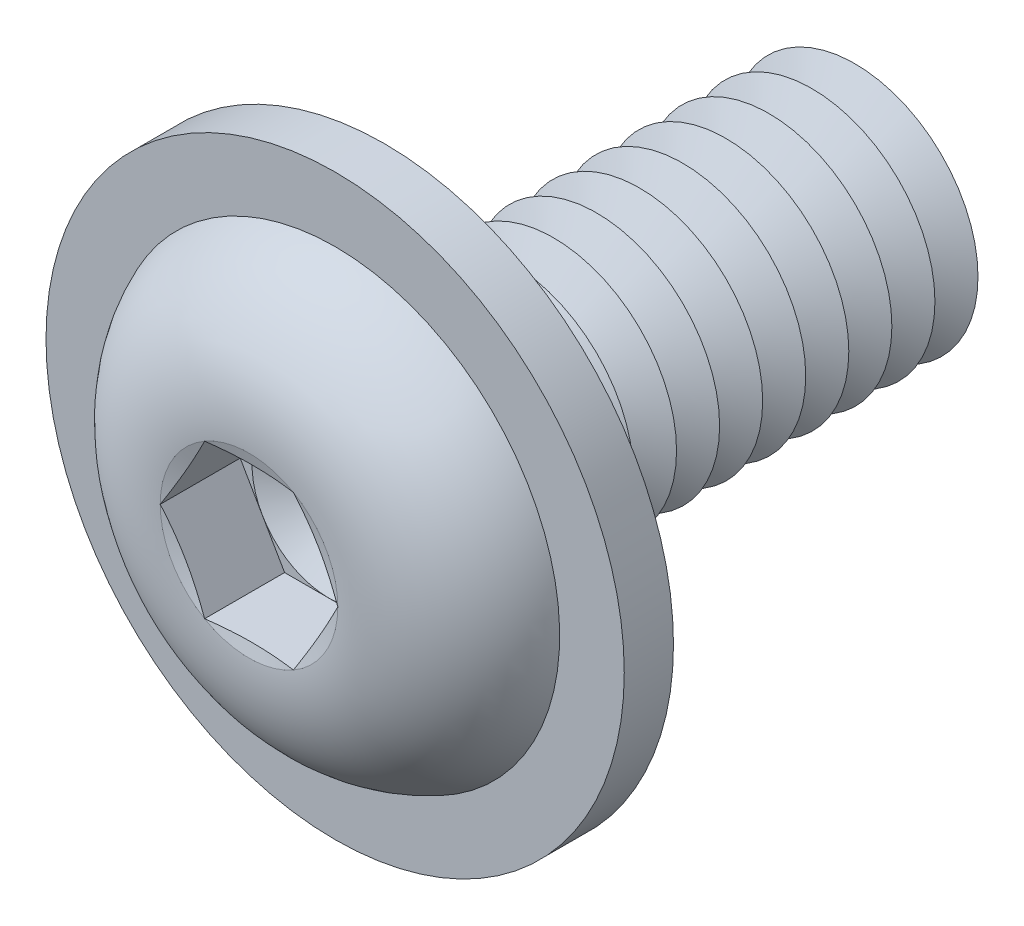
ISO-10303-21;
HEADER;
FILE_DESCRIPTION(('STEP AP214'),'2;1');
FILE_NAME('part.step','',(''),(''),'','','');
FILE_SCHEMA(('AUTOMOTIVE_DESIGN { 1 0 10303 214 1 1 1 1 }'));
ENDSEC;
DATA;
#1=APPLICATION_CONTEXT('core data for automotive mechanical design processes');
#2=APPLICATION_PROTOCOL_DEFINITION('international standard','automotive_design',2000,#1);
#3=PRODUCT_CONTEXT('',#1,'mechanical');
#4=PRODUCT('Part','Part','',(#3));
#5=PRODUCT_RELATED_PRODUCT_CATEGORY('part','',(#4));
#6=PRODUCT_DEFINITION_FORMATION('','',#4);
#7=PRODUCT_DEFINITION_CONTEXT('part definition',#1,'design');
#8=PRODUCT_DEFINITION('design','',#6,#7);
#9=PRODUCT_DEFINITION_SHAPE('','',#8);
#10=(LENGTH_UNIT() NAMED_UNIT(*) SI_UNIT(.MILLI.,.METRE.));
#11=(NAMED_UNIT(*) PLANE_ANGLE_UNIT() SI_UNIT($,.RADIAN.));
#12=(NAMED_UNIT(*) SI_UNIT($,.STERADIAN.) SOLID_ANGLE_UNIT());
#13=UNCERTAINTY_MEASURE_WITH_UNIT(LENGTH_MEASURE(1.E-05),#10,'distance_accuracy_value','');
#14=(GEOMETRIC_REPRESENTATION_CONTEXT(3) GLOBAL_UNCERTAINTY_ASSIGNED_CONTEXT((#13)) GLOBAL_UNIT_ASSIGNED_CONTEXT((#10,
#11,#12)) REPRESENTATION_CONTEXT('',''));
#15=CARTESIAN_POINT('',(0.,0.,0.));
#16=DIRECTION('',(0.,0.,1.));
#17=DIRECTION('',(1.,0.,0.));
#18=AXIS2_PLACEMENT_3D('',#15,#16,#17);
#19=CARTESIAN_POINT('',(0.,0.,-5.55));
#20=DIRECTION('',(0.,0.,1.));
#21=DIRECTION('',(1.,0.,0.));
#22=AXIS2_PLACEMENT_3D('',#19,#20,#21);
#23=CONICAL_SURFACE('',#22,2.,1.0471975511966);
#24=CARTESIAN_POINT('',(0.,0.,-5.9));
#25=DIRECTION('',(0.,0.,1.));
#26=DIRECTION('',(1.,0.,0.));
#27=AXIS2_PLACEMENT_3D('',#24,#25,#26);
#28=CIRCLE('',#27,1.3937822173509);
#29=CARTESIAN_POINT('',(1.3937822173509,0.,-5.9));
#30=VERTEX_POINT('',#29);
#31=EDGE_CURVE('E298',#30,#30,#28,.T.);
#32=ORIENTED_EDGE('',*,*,#31,.T.);
#33=EDGE_LOOP('',(#32));
#34=FACE_BOUND('',#33,.T.);
#35=CARTESIAN_POINT('',(0.,0.,-5.55));
#36=DIRECTION('',(0.,0.,1.));
#37=DIRECTION('',(1.,0.,0.));
#38=AXIS2_PLACEMENT_3D('',#35,#36,#37);
#39=CIRCLE('',#38,2.);
#40=CARTESIAN_POINT('',(2.,0.,-5.55));
#41=VERTEX_POINT('',#40);
#42=EDGE_CURVE('E294',#41,#41,#39,.T.);
#43=ORIENTED_EDGE('',*,*,#42,.F.);
#44=EDGE_LOOP('',(#43));
#45=FACE_BOUND('',#44,.T.);
#46=ADVANCED_FACE('F39',(#34,#45),#23,.T.);
#47=CARTESIAN_POINT('',(0.,0.,-5.9));
#48=DIRECTION('',(0.,0.,-1.));
#49=DIRECTION('',(-1.,0.,0.));
#50=AXIS2_PLACEMENT_3D('',#47,#48,#49);
#51=CONICAL_SURFACE('',#50,1.3937822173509,1.0471975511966);
#52=CARTESIAN_POINT('',(0.,0.,-6.25));
#53=DIRECTION('',(0.,0.,1.));
#54=DIRECTION('',(1.,0.,0.));
#55=AXIS2_PLACEMENT_3D('',#52,#53,#54);
#56=CIRCLE('',#55,2.);
#57=CARTESIAN_POINT('',(2.,0.,-6.25));
#58=VERTEX_POINT('',#57);
#59=EDGE_CURVE('E302',#58,#58,#56,.T.);
#60=ORIENTED_EDGE('',*,*,#59,.T.);
#61=EDGE_LOOP('',(#60));
#62=FACE_BOUND('',#61,.T.);
#63=ORIENTED_EDGE('',*,*,#31,.F.);
#64=EDGE_LOOP('',(#63));
#65=FACE_BOUND('',#64,.T.);
#66=ADVANCED_FACE('F427',(#62,#65),#51,.T.);
#67=CARTESIAN_POINT('',(0.,2.,-8.));
#68=DIRECTION('',(0.,0.,-1.));
#69=DIRECTION('',(-1.,0.,0.));
#70=AXIS2_PLACEMENT_3D('',#67,#68,#69);
#71=PLANE('',#70);
#72=CARTESIAN_POINT('',(0.,0.,-8.));
#73=DIRECTION('',(0.,0.,1.));
#74=DIRECTION('',(1.,0.,0.));
#75=AXIS2_PLACEMENT_3D('',#72,#73,#74);
#76=CIRCLE('',#75,1.3937822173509);
#77=CARTESIAN_POINT('',(1.3937822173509,0.,-8.));
#78=VERTEX_POINT('',#77);
#79=EDGE_CURVE('E322',#78,#78,#76,.T.);
#80=ORIENTED_EDGE('',*,*,#79,.F.);
#81=EDGE_LOOP('',(#80));
#82=FACE_BOUND('',#81,.T.);
#83=ADVANCED_FACE('F433',(#82),#71,.T.);
#84=CARTESIAN_POINT('',(0.,0.,-7.65));
#85=DIRECTION('',(0.,0.,1.));
#86=DIRECTION('',(1.,0.,0.));
#87=AXIS2_PLACEMENT_3D('',#84,#85,#86);
#88=CONICAL_SURFACE('',#87,2.,1.0471975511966);
#89=ORIENTED_EDGE('',*,*,#79,.T.);
#90=EDGE_LOOP('',(#89));
#91=FACE_BOUND('',#90,.T.);
#92=CARTESIAN_POINT('',(0.,0.,-7.65));
#93=DIRECTION('',(0.,0.,1.));
#94=DIRECTION('',(1.,0.,0.));
#95=AXIS2_PLACEMENT_3D('',#92,#93,#94);
#96=CIRCLE('',#95,2.);
#97=CARTESIAN_POINT('',(2.,0.,-7.65));
#98=VERTEX_POINT('',#97);
#99=EDGE_CURVE('E318',#98,#98,#96,.T.);
#100=ORIENTED_EDGE('',*,*,#99,.F.);
#101=EDGE_LOOP('',(#100));
#102=FACE_BOUND('',#101,.T.);
#103=ADVANCED_FACE('F452',(#91,#102),#88,.T.);
#104=CARTESIAN_POINT('',(0.,0.,-7.3));
#105=DIRECTION('',(0.,0.,-1.));
#106=DIRECTION('',(-1.,0.,0.));
#107=AXIS2_PLACEMENT_3D('',#104,#105,#106);
#108=CONICAL_SURFACE('',#107,1.3937822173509,1.0471975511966);
#109=ORIENTED_EDGE('',*,*,#99,.T.);
#110=EDGE_LOOP('',(#109));
#111=FACE_BOUND('',#110,.T.);
#112=CARTESIAN_POINT('',(0.,0.,-7.3));
#113=DIRECTION('',(0.,0.,1.));
#114=DIRECTION('',(1.,0.,0.));
#115=AXIS2_PLACEMENT_3D('',#112,#113,#114);
#116=CIRCLE('',#115,1.3937822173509);
#117=CARTESIAN_POINT('',(1.3937822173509,0.,-7.3));
#118=VERTEX_POINT('',#117);
#119=EDGE_CURVE('E314',#118,#118,#116,.T.);
#120=ORIENTED_EDGE('',*,*,#119,.F.);
#121=EDGE_LOOP('',(#120));
#122=FACE_BOUND('',#121,.T.);
#123=ADVANCED_FACE('F449',(#111,#122),#108,.T.);
#124=CARTESIAN_POINT('',(0.,0.,-6.95));
#125=DIRECTION('',(0.,0.,1.));
#126=DIRECTION('',(1.,0.,0.));
#127=AXIS2_PLACEMENT_3D('',#124,#125,#126);
#128=CONICAL_SURFACE('',#127,2.,1.0471975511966);
#129=ORIENTED_EDGE('',*,*,#119,.T.);
#130=EDGE_LOOP('',(#129));
#131=FACE_BOUND('',#130,.T.);
#132=CARTESIAN_POINT('',(0.,0.,-6.95));
#133=DIRECTION('',(0.,0.,1.));
#134=DIRECTION('',(1.,0.,0.));
#135=AXIS2_PLACEMENT_3D('',#132,#133,#134);
#136=CIRCLE('',#135,2.);
#137=CARTESIAN_POINT('',(2.,0.,-6.95));
#138=VERTEX_POINT('',#137);
#139=EDGE_CURVE('E310',#138,#138,#136,.T.);
#140=ORIENTED_EDGE('',*,*,#139,.F.);
#141=EDGE_LOOP('',(#140));
#142=FACE_BOUND('',#141,.T.);
#143=ADVANCED_FACE('F443',(#131,#142),#128,.T.);
#144=CARTESIAN_POINT('',(0.,0.,-6.6));
#145=DIRECTION('',(0.,0.,-1.));
#146=DIRECTION('',(-1.,0.,0.));
#147=AXIS2_PLACEMENT_3D('',#144,#145,#146);
#148=CONICAL_SURFACE('',#147,1.3937822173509,1.0471975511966);
#149=ORIENTED_EDGE('',*,*,#139,.T.);
#150=EDGE_LOOP('',(#149));
#151=FACE_BOUND('',#150,.T.);
#152=CARTESIAN_POINT('',(0.,0.,-6.6));
#153=DIRECTION('',(0.,0.,1.));
#154=DIRECTION('',(1.,0.,0.));
#155=AXIS2_PLACEMENT_3D('',#152,#153,#154);
#156=CIRCLE('',#155,1.3937822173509);
#157=CARTESIAN_POINT('',(1.3937822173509,0.,-6.6));
#158=VERTEX_POINT('',#157);
#159=EDGE_CURVE('E306',#158,#158,#156,.T.);
#160=ORIENTED_EDGE('',*,*,#159,.F.);
#161=EDGE_LOOP('',(#160));
#162=FACE_BOUND('',#161,.T.);
#163=ADVANCED_FACE('F439',(#151,#162),#148,.T.);
#164=CARTESIAN_POINT('',(0.,0.,-6.25));
#165=DIRECTION('',(0.,0.,1.));
#166=DIRECTION('',(1.,0.,0.));
#167=AXIS2_PLACEMENT_3D('',#164,#165,#166);
#168=CONICAL_SURFACE('',#167,2.,1.0471975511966);
#169=ORIENTED_EDGE('',*,*,#159,.T.);
#170=EDGE_LOOP('',(#169));
#171=FACE_BOUND('',#170,.T.);
#172=ORIENTED_EDGE('',*,*,#59,.F.);
#173=EDGE_LOOP('',(#172));
#174=FACE_BOUND('',#173,.T.);
#175=ADVANCED_FACE('F442',(#171,#174),#168,.T.);
#176=CARTESIAN_POINT('',(0.,0.,-4.85));
#177=DIRECTION('',(0.,0.,1.));
#178=DIRECTION('',(1.,0.,0.));
#179=AXIS2_PLACEMENT_3D('',#176,#177,#178);
#180=CONICAL_SURFACE('',#179,2.,1.0471975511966);
#181=CARTESIAN_POINT('',(0.,0.,-5.2));
#182=DIRECTION('',(0.,0.,1.));
#183=DIRECTION('',(1.,0.,0.));
#184=AXIS2_PLACEMENT_3D('',#181,#182,#183);
#185=CIRCLE('',#184,1.3937822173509);
#186=CARTESIAN_POINT('',(1.3937822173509,0.,-5.2));
#187=VERTEX_POINT('',#186);
#188=EDGE_CURVE('E290',#187,#187,#185,.T.);
#189=ORIENTED_EDGE('',*,*,#188,.T.);
#190=EDGE_LOOP('',(#189));
#191=FACE_BOUND('',#190,.T.);
#192=CARTESIAN_POINT('',(0.,0.,-4.85));
#193=DIRECTION('',(0.,0.,1.));
#194=DIRECTION('',(1.,0.,0.));
#195=AXIS2_PLACEMENT_3D('',#192,#193,#194);
#196=CIRCLE('',#195,2.);
#197=CARTESIAN_POINT('',(2.,0.,-4.85));
#198=VERTEX_POINT('',#197);
#199=EDGE_CURVE('E286',#198,#198,#196,.T.);
#200=ORIENTED_EDGE('',*,*,#199,.F.);
#201=EDGE_LOOP('',(#200));
#202=FACE_BOUND('',#201,.T.);
#203=ADVANCED_FACE('F447',(#191,#202),#180,.T.);
#204=CARTESIAN_POINT('',(0.,0.,-5.2));
#205=DIRECTION('',(0.,0.,-1.));
#206=DIRECTION('',(-1.,0.,0.));
#207=AXIS2_PLACEMENT_3D('',#204,#205,#206);
#208=CONICAL_SURFACE('',#207,1.3937822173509,1.0471975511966);
#209=ORIENTED_EDGE('',*,*,#42,.T.);
#210=EDGE_LOOP('',(#209));
#211=FACE_BOUND('',#210,.T.);
#212=ORIENTED_EDGE('',*,*,#188,.F.);
#213=EDGE_LOOP('',(#212));
#214=FACE_BOUND('',#213,.T.);
#215=ADVANCED_FACE('F498',(#211,#214),#208,.T.);
#216=CARTESIAN_POINT('',(0.,0.,-4.15));
#217=DIRECTION('',(0.,0.,1.));
#218=DIRECTION('',(1.,0.,0.));
#219=AXIS2_PLACEMENT_3D('',#216,#217,#218);
#220=CONICAL_SURFACE('',#219,2.,1.0471975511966);
#221=CARTESIAN_POINT('',(0.,0.,-4.5));
#222=DIRECTION('',(0.,0.,1.));
#223=DIRECTION('',(1.,0.,0.));
#224=AXIS2_PLACEMENT_3D('',#221,#222,#223);
#225=CIRCLE('',#224,1.3937822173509);
#226=CARTESIAN_POINT('',(1.3937822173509,0.,-4.5));
#227=VERTEX_POINT('',#226);
#228=EDGE_CURVE('E282',#227,#227,#225,.T.);
#229=ORIENTED_EDGE('',*,*,#228,.T.);
#230=EDGE_LOOP('',(#229));
#231=FACE_BOUND('',#230,.T.);
#232=CARTESIAN_POINT('',(0.,0.,-4.15));
#233=DIRECTION('',(0.,0.,1.));
#234=DIRECTION('',(1.,0.,0.));
#235=AXIS2_PLACEMENT_3D('',#232,#233,#234);
#236=CIRCLE('',#235,2.);
#237=CARTESIAN_POINT('',(2.,0.,-4.15));
#238=VERTEX_POINT('',#237);
#239=EDGE_CURVE('E278',#238,#238,#236,.T.);
#240=ORIENTED_EDGE('',*,*,#239,.F.);
#241=EDGE_LOOP('',(#240));
#242=FACE_BOUND('',#241,.T.);
#243=ADVANCED_FACE('F504',(#231,#242),#220,.T.);
#244=CARTESIAN_POINT('',(0.,0.,-4.5));
#245=DIRECTION('',(0.,0.,-1.));
#246=DIRECTION('',(-1.,0.,0.));
#247=AXIS2_PLACEMENT_3D('',#244,#245,#246);
#248=CONICAL_SURFACE('',#247,1.3937822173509,1.0471975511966);
#249=ORIENTED_EDGE('',*,*,#199,.T.);
#250=EDGE_LOOP('',(#249));
#251=FACE_BOUND('',#250,.T.);
#252=ORIENTED_EDGE('',*,*,#228,.F.);
#253=EDGE_LOOP('',(#252));
#254=FACE_BOUND('',#253,.T.);
#255=ADVANCED_FACE('F511',(#251,#254),#248,.T.);
#256=CARTESIAN_POINT('',(0.,0.,-3.45));
#257=DIRECTION('',(0.,0.,1.));
#258=DIRECTION('',(1.,0.,0.));
#259=AXIS2_PLACEMENT_3D('',#256,#257,#258);
#260=CONICAL_SURFACE('',#259,2.,1.0471975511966);
#261=CARTESIAN_POINT('',(0.,0.,-3.8));
#262=DIRECTION('',(0.,0.,1.));
#263=DIRECTION('',(1.,0.,0.));
#264=AXIS2_PLACEMENT_3D('',#261,#262,#263);
#265=CIRCLE('',#264,1.3937822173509);
#266=CARTESIAN_POINT('',(1.3937822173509,0.,-3.8));
#267=VERTEX_POINT('',#266);
#268=EDGE_CURVE('E274',#267,#267,#265,.T.);
#269=ORIENTED_EDGE('',*,*,#268,.T.);
#270=EDGE_LOOP('',(#269));
#271=FACE_BOUND('',#270,.T.);
#272=CARTESIAN_POINT('',(0.,0.,-3.45));
#273=DIRECTION('',(0.,0.,1.));
#274=DIRECTION('',(1.,0.,0.));
#275=AXIS2_PLACEMENT_3D('',#272,#273,#274);
#276=CIRCLE('',#275,2.);
#277=CARTESIAN_POINT('',(2.,0.,-3.45));
#278=VERTEX_POINT('',#277);
#279=EDGE_CURVE('E270',#278,#278,#276,.T.);
#280=ORIENTED_EDGE('',*,*,#279,.F.);
#281=EDGE_LOOP('',(#280));
#282=FACE_BOUND('',#281,.T.);
#283=ADVANCED_FACE('F518',(#271,#282),#260,.T.);
#284=CARTESIAN_POINT('',(0.,0.,-3.8));
#285=DIRECTION('',(0.,0.,-1.));
#286=DIRECTION('',(-1.,0.,0.));
#287=AXIS2_PLACEMENT_3D('',#284,#285,#286);
#288=CONICAL_SURFACE('',#287,1.3937822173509,1.0471975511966);
#289=ORIENTED_EDGE('',*,*,#239,.T.);
#290=EDGE_LOOP('',(#289));
#291=FACE_BOUND('',#290,.T.);
#292=ORIENTED_EDGE('',*,*,#268,.F.);
#293=EDGE_LOOP('',(#292));
#294=FACE_BOUND('',#293,.T.);
#295=ADVANCED_FACE('F525',(#291,#294),#288,.T.);
#296=CARTESIAN_POINT('',(0.,0.,-2.75));
#297=DIRECTION('',(0.,0.,1.));
#298=DIRECTION('',(1.,0.,0.));
#299=AXIS2_PLACEMENT_3D('',#296,#297,#298);
#300=CONICAL_SURFACE('',#299,2.,1.0471975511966);
#301=CARTESIAN_POINT('',(0.,0.,-3.1));
#302=DIRECTION('',(0.,0.,1.));
#303=DIRECTION('',(1.,0.,0.));
#304=AXIS2_PLACEMENT_3D('',#301,#302,#303);
#305=CIRCLE('',#304,1.3937822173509);
#306=CARTESIAN_POINT('',(1.3937822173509,0.,-3.1));
#307=VERTEX_POINT('',#306);
#308=EDGE_CURVE('E266',#307,#307,#305,.T.);
#309=ORIENTED_EDGE('',*,*,#308,.T.);
#310=EDGE_LOOP('',(#309));
#311=FACE_BOUND('',#310,.T.);
#312=CARTESIAN_POINT('',(0.,0.,-2.75));
#313=DIRECTION('',(0.,0.,1.));
#314=DIRECTION('',(1.,0.,0.));
#315=AXIS2_PLACEMENT_3D('',#312,#313,#314);
#316=CIRCLE('',#315,2.);
#317=CARTESIAN_POINT('',(2.,0.,-2.75));
#318=VERTEX_POINT('',#317);
#319=EDGE_CURVE('E262',#318,#318,#316,.T.);
#320=ORIENTED_EDGE('',*,*,#319,.F.);
#321=EDGE_LOOP('',(#320));
#322=FACE_BOUND('',#321,.T.);
#323=ADVANCED_FACE('F532',(#311,#322),#300,.T.);
#324=CARTESIAN_POINT('',(0.,0.,-3.1));
#325=DIRECTION('',(0.,0.,-1.));
#326=DIRECTION('',(-1.,0.,0.));
#327=AXIS2_PLACEMENT_3D('',#324,#325,#326);
#328=CONICAL_SURFACE('',#327,1.3937822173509,1.0471975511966);
#329=ORIENTED_EDGE('',*,*,#279,.T.);
#330=EDGE_LOOP('',(#329));
#331=FACE_BOUND('',#330,.T.);
#332=ORIENTED_EDGE('',*,*,#308,.F.);
#333=EDGE_LOOP('',(#332));
#334=FACE_BOUND('',#333,.T.);
#335=ADVANCED_FACE('F539',(#331,#334),#328,.T.);
#336=CARTESIAN_POINT('',(0.,0.,-2.05));
#337=DIRECTION('',(0.,0.,1.));
#338=DIRECTION('',(1.,0.,0.));
#339=AXIS2_PLACEMENT_3D('',#336,#337,#338);
#340=CONICAL_SURFACE('',#339,2.,1.0471975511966);
#341=CARTESIAN_POINT('',(0.,0.,-2.4));
#342=DIRECTION('',(0.,0.,1.));
#343=DIRECTION('',(1.,0.,0.));
#344=AXIS2_PLACEMENT_3D('',#341,#342,#343);
#345=CIRCLE('',#344,1.3937822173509);
#346=CARTESIAN_POINT('',(1.3937822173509,0.,-2.4));
#347=VERTEX_POINT('',#346);
#348=EDGE_CURVE('E258',#347,#347,#345,.T.);
#349=ORIENTED_EDGE('',*,*,#348,.T.);
#350=EDGE_LOOP('',(#349));
#351=FACE_BOUND('',#350,.T.);
#352=CARTESIAN_POINT('',(0.,0.,-2.05));
#353=DIRECTION('',(0.,0.,1.));
#354=DIRECTION('',(1.,0.,0.));
#355=AXIS2_PLACEMENT_3D('',#352,#353,#354);
#356=CIRCLE('',#355,2.);
#357=CARTESIAN_POINT('',(2.,0.,-2.05));
#358=VERTEX_POINT('',#357);
#359=EDGE_CURVE('E254',#358,#358,#356,.T.);
#360=ORIENTED_EDGE('',*,*,#359,.F.);
#361=EDGE_LOOP('',(#360));
#362=FACE_BOUND('',#361,.T.);
#363=ADVANCED_FACE('F546',(#351,#362),#340,.T.);
#364=CARTESIAN_POINT('',(0.,0.,-2.4));
#365=DIRECTION('',(0.,0.,-1.));
#366=DIRECTION('',(-1.,0.,0.));
#367=AXIS2_PLACEMENT_3D('',#364,#365,#366);
#368=CONICAL_SURFACE('',#367,1.3937822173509,1.0471975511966);
#369=ORIENTED_EDGE('',*,*,#319,.T.);
#370=EDGE_LOOP('',(#369));
#371=FACE_BOUND('',#370,.T.);
#372=ORIENTED_EDGE('',*,*,#348,.F.);
#373=EDGE_LOOP('',(#372));
#374=FACE_BOUND('',#373,.T.);
#375=ADVANCED_FACE('F553',(#371,#374),#368,.T.);
#376=CARTESIAN_POINT('',(0.,0.,-1.35));
#377=DIRECTION('',(0.,0.,1.));
#378=DIRECTION('',(1.,0.,0.));
#379=AXIS2_PLACEMENT_3D('',#376,#377,#378);
#380=CONICAL_SURFACE('',#379,2.,1.0471975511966);
#381=CARTESIAN_POINT('',(0.,0.,-1.7));
#382=DIRECTION('',(0.,0.,1.));
#383=DIRECTION('',(1.,0.,0.));
#384=AXIS2_PLACEMENT_3D('',#381,#382,#383);
#385=CIRCLE('',#384,1.3937822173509);
#386=CARTESIAN_POINT('',(1.3937822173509,0.,-1.7));
#387=VERTEX_POINT('',#386);
#388=EDGE_CURVE('E250',#387,#387,#385,.T.);
#389=ORIENTED_EDGE('',*,*,#388,.T.);
#390=EDGE_LOOP('',(#389));
#391=FACE_BOUND('',#390,.T.);
#392=CARTESIAN_POINT('',(0.,0.,-1.35));
#393=DIRECTION('',(0.,0.,1.));
#394=DIRECTION('',(1.,0.,0.));
#395=AXIS2_PLACEMENT_3D('',#392,#393,#394);
#396=CIRCLE('',#395,2.);
#397=CARTESIAN_POINT('',(2.,0.,-1.35));
#398=VERTEX_POINT('',#397);
#399=EDGE_CURVE('E242',#398,#398,#396,.T.);
#400=ORIENTED_EDGE('',*,*,#399,.F.);
#401=EDGE_LOOP('',(#400));
#402=FACE_BOUND('',#401,.T.);
#403=ADVANCED_FACE('F560',(#391,#402),#380,.T.);
#404=CARTESIAN_POINT('',(0.,0.,-1.7));
#405=DIRECTION('',(0.,0.,-1.));
#406=DIRECTION('',(-1.,0.,0.));
#407=AXIS2_PLACEMENT_3D('',#404,#405,#406);
#408=CONICAL_SURFACE('',#407,1.3937822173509,1.0471975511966);
#409=ORIENTED_EDGE('',*,*,#359,.T.);
#410=EDGE_LOOP('',(#409));
#411=FACE_BOUND('',#410,.T.);
#412=ORIENTED_EDGE('',*,*,#388,.F.);
#413=EDGE_LOOP('',(#412));
#414=FACE_BOUND('',#413,.T.);
#415=ADVANCED_FACE('F567',(#411,#414),#408,.T.);
#416=CARTESIAN_POINT('',(0.,0.,-0.65));
#417=DIRECTION('',(0.,0.,1.));
#418=DIRECTION('',(1.,0.,0.));
#419=AXIS2_PLACEMENT_3D('',#416,#417,#418);
#420=CONICAL_SURFACE('',#419,2.,1.0471975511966);
#421=CARTESIAN_POINT('',(0.,0.,-1.));
#422=DIRECTION('',(0.,0.,1.));
#423=DIRECTION('',(1.,0.,0.));
#424=AXIS2_PLACEMENT_3D('',#421,#422,#423);
#425=CIRCLE('',#424,1.3937822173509);
#426=CARTESIAN_POINT('',(1.3937822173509,0.,-1.));
#427=VERTEX_POINT('',#426);
#428=EDGE_CURVE('E231',#427,#427,#425,.T.);
#429=ORIENTED_EDGE('',*,*,#428,.T.);
#430=EDGE_LOOP('',(#429));
#431=FACE_BOUND('',#430,.T.);
#432=CARTESIAN_POINT('',(0.,0.,-0.65));
#433=DIRECTION('',(0.,0.,1.));
#434=DIRECTION('',(1.,0.,0.));
#435=AXIS2_PLACEMENT_3D('',#432,#433,#434);
#436=CIRCLE('',#435,2.);
#437=CARTESIAN_POINT('',(2.,0.,-0.65));
#438=VERTEX_POINT('',#437);
#439=EDGE_CURVE('E246',#438,#438,#436,.T.);
#440=ORIENTED_EDGE('',*,*,#439,.F.);
#441=EDGE_LOOP('',(#440));
#442=FACE_BOUND('',#441,.T.);
#443=ADVANCED_FACE('F574',(#431,#442),#420,.T.);
#444=CARTESIAN_POINT('',(0.,0.,-1.));
#445=DIRECTION('',(0.,0.,-1.));
#446=DIRECTION('',(-1.,0.,0.));
#447=AXIS2_PLACEMENT_3D('',#444,#445,#446);
#448=CONICAL_SURFACE('',#447,1.3937822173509,1.0471975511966);
#449=ORIENTED_EDGE('',*,*,#399,.T.);
#450=EDGE_LOOP('',(#449));
#451=FACE_BOUND('',#450,.T.);
#452=ORIENTED_EDGE('',*,*,#428,.F.);
#453=EDGE_LOOP('',(#452));
#454=FACE_BOUND('',#453,.T.);
#455=ADVANCED_FACE('F220',(#451,#454),#448,.T.);
#456=CARTESIAN_POINT('',(0.,2.,0.));
#457=DIRECTION('',(0.,0.,-1.));
#458=DIRECTION('',(-1.,0.,0.));
#459=AXIS2_PLACEMENT_3D('',#456,#457,#458);
#460=PLANE('',#459);
#461=CARTESIAN_POINT('',(0.,0.,0.));
#462=DIRECTION('',(0.,0.,-1.));
#463=DIRECTION('',(-1.,0.,0.));
#464=AXIS2_PLACEMENT_3D('',#461,#462,#463);
#465=CIRCLE('',#464,2.35);
#466=CARTESIAN_POINT('',(-2.35,0.,0.));
#467=VERTEX_POINT('',#466);
#468=EDGE_CURVE('E336',#467,#467,#465,.F.);
#469=ORIENTED_EDGE('',*,*,#468,.T.);
#470=EDGE_LOOP('',(#469));
#471=FACE_BOUND('',#470,.T.);
#472=CARTESIAN_POINT('',(0.,0.,0.));
#473=DIRECTION('',(0.,0.,-1.));
#474=DIRECTION('',(0.,1.,0.));
#475=AXIS2_PLACEMENT_3D('',#472,#473,#474);
#476=CIRCLE('',#475,4.7);
#477=CARTESIAN_POINT('',(0.,4.7,0.));
#478=VERTEX_POINT('',#477);
#479=EDGE_CURVE('E900',#478,#478,#476,.T.);
#480=ORIENTED_EDGE('',*,*,#479,.T.);
#481=EDGE_LOOP('',(#480));
#482=FACE_BOUND('',#481,.T.);
#483=ADVANCED_FACE('F586',(#471,#482),#460,.T.);
#484=CARTESIAN_POINT('',(0.,0.,-0.35));
#485=DIRECTION('',(0.,0.,-1.));
#486=DIRECTION('',(-1.,0.,0.));
#487=AXIS2_PLACEMENT_3D('',#484,#485,#486);
#488=TOROIDAL_SURFACE('',#487,2.35,0.35);
#489=ORIENTED_EDGE('',*,*,#468,.F.);
#490=EDGE_LOOP('',(#489));
#491=FACE_BOUND('',#490,.T.);
#492=CARTESIAN_POINT('',(0.,0.,-0.35));
#493=DIRECTION('',(0.,0.,-1.));
#494=DIRECTION('',(-1.,0.,0.));
#495=AXIS2_PLACEMENT_3D('',#492,#493,#494);
#496=CIRCLE('',#495,2.);
#497=CARTESIAN_POINT('',(-2.,0.,-0.35));
#498=VERTEX_POINT('',#497);
#499=EDGE_CURVE('E331',#498,#498,#496,.T.);
#500=ORIENTED_EDGE('',*,*,#499,.F.);
#501=EDGE_LOOP('',(#500));
#502=FACE_BOUND('',#501,.T.);
#503=ADVANCED_FACE('F41',(#491,#502),#488,.F.);
#504=CARTESIAN_POINT('',(0.,0.,-8.));
#505=DIRECTION('',(0.,0.,-1.));
#506=DIRECTION('',(-1.,0.,0.));
#507=AXIS2_PLACEMENT_3D('',#504,#505,#506);
#508=CYLINDRICAL_SURFACE('',#507,2.);
#509=ORIENTED_EDGE('',*,*,#499,.T.);
#510=EDGE_LOOP('',(#509));
#511=FACE_BOUND('',#510,.T.);
#512=ORIENTED_EDGE('',*,*,#439,.T.);
#513=EDGE_LOOP('',(#512));
#514=FACE_BOUND('',#513,.T.);
#515=ADVANCED_FACE('F598',(#511,#514),#508,.T.);
#516=CARTESIAN_POINT('',(0.,0.,0.8));
#517=DIRECTION('',(0.,0.,-1.));
#518=DIRECTION('',(0.,1.,0.));
#519=AXIS2_PLACEMENT_3D('',#516,#517,#518);
#520=CYLINDRICAL_SURFACE('',#519,4.7);
#521=CARTESIAN_POINT('',(0.,0.,0.8));
#522=DIRECTION('',(0.,0.,-1.));
#523=DIRECTION('',(0.,1.,0.));
#524=AXIS2_PLACEMENT_3D('',#521,#522,#523);
#525=CIRCLE('',#524,4.7);
#526=CARTESIAN_POINT('',(0.,4.7,0.8));
#527=VERTEX_POINT('',#526);
#528=EDGE_CURVE('E898',#527,#527,#525,.T.);
#529=ORIENTED_EDGE('',*,*,#528,.T.);
#530=EDGE_LOOP('',(#529));
#531=FACE_BOUND('',#530,.T.);
#532=ORIENTED_EDGE('',*,*,#479,.F.);
#533=EDGE_LOOP('',(#532));
#534=FACE_BOUND('',#533,.T.);
#535=ADVANCED_FACE('F604',(#531,#534),#520,.T.);
#536=CARTESIAN_POINT('',(0.,0.,0.8));
#537=DIRECTION('',(0.,0.,-1.));
#538=DIRECTION('',(0.,1.,0.));
#539=AXIS2_PLACEMENT_3D('',#536,#537,#538);
#540=PLANE('',#539);
#541=CARTESIAN_POINT('',(0.,0.,0.8));
#542=DIRECTION('',(0.,0.,-1.));
#543=DIRECTION('',(0.,1.,0.));
#544=AXIS2_PLACEMENT_3D('',#541,#542,#543);
#545=CIRCLE('',#544,3.64977164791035);
#546=CARTESIAN_POINT('',(0.,3.64977164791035,0.8));
#547=VERTEX_POINT('',#546);
#548=EDGE_CURVE('E43',#547,#547,#545,.F.);
#549=ORIENTED_EDGE('',*,*,#548,.F.);
#550=EDGE_LOOP('',(#549));
#551=FACE_BOUND('',#550,.T.);
#552=ORIENTED_EDGE('',*,*,#528,.F.);
#553=EDGE_LOOP('',(#552));
#554=FACE_BOUND('',#553,.T.);
#555=ADVANCED_FACE('F117',(#551,#554),#540,.F.);
#556=CARTESIAN_POINT('',(0.,0.,0.9));
#557=DIRECTION('',(0.,0.,1.));
#558=DIRECTION('',(1.,0.,0.));
#559=AXIS2_PLACEMENT_3D('',#556,#557,#558);
#560=CONICAL_SURFACE('',#559,1.24999941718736,1.0471975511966);
#561=CARTESIAN_POINT('',(0.,0.,0.178312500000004));
#562=VERTEX_POINT('',#561);
#563=VERTEX_LOOP('',#562);
#564=FACE_BOUND('',#563,.T.);
#565=CARTESIAN_POINT('',(0.,0.,0.9));
#566=DIRECTION('',(0.,0.,1.));
#567=DIRECTION('',(1.,0.,0.));
#568=AXIS2_PLACEMENT_3D('',#565,#566,#567);
#569=CIRCLE('',#568,1.24999941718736);
#570=CARTESIAN_POINT('',(1.08253125,0.624999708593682,0.9));
#571=VERTEX_POINT('',#570);
#572=CARTESIAN_POINT('',(0.,1.24999941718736,0.9));
#573=VERTEX_POINT('',#572);
#574=EDGE_CURVE('E120',#571,#573,#569,.T.);
#575=ORIENTED_EDGE('',*,*,#574,.T.);
#576=CARTESIAN_POINT('',(0.,0.,0.9));
#577=DIRECTION('',(0.,0.,1.));
#578=DIRECTION('',(1.,0.,0.));
#579=AXIS2_PLACEMENT_3D('',#576,#577,#578);
#580=CIRCLE('',#579,1.24999941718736);
#581=CARTESIAN_POINT('',(-1.08253125,0.624999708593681,0.9));
#582=VERTEX_POINT('',#581);
#583=EDGE_CURVE('E11',#573,#582,#580,.T.);
#584=ORIENTED_EDGE('',*,*,#583,.T.);
#585=CARTESIAN_POINT('',(-1.08253125,-0.624999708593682,0.9));
#586=VERTEX_POINT('',#585);
#587=EDGE_CURVE('E49',#582,#586,#580,.T.);
#588=ORIENTED_EDGE('',*,*,#587,.T.);
#589=CARTESIAN_POINT('',(0.,-1.24999941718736,0.9));
#590=VERTEX_POINT('',#589);
#591=EDGE_CURVE('E341',#586,#590,#580,.T.);
#592=ORIENTED_EDGE('',*,*,#591,.T.);
#593=CARTESIAN_POINT('',(1.08253125,-0.624999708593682,0.9));
#594=VERTEX_POINT('',#593);
#595=EDGE_CURVE('E57',#590,#594,#580,.T.);
#596=ORIENTED_EDGE('',*,*,#595,.T.);
#597=EDGE_CURVE('E50',#594,#571,#580,.T.);
#598=ORIENTED_EDGE('',*,*,#597,.T.);
#599=EDGE_LOOP('',(#575,#584,#588,#592,#596,#598));
#600=FACE_BOUND('',#599,.T.);
#601=ADVANCED_FACE('F114',(#564,#600),#560,.F.);
#602=CARTESIAN_POINT('',(0.,0.,0.9));
#603=DIRECTION('',(0.,0.,1.));
#604=DIRECTION('',(1.,0.,0.));
#605=AXIS2_PLACEMENT_3D('',#602,#603,#604);
#606=PLANE('',#605);
#607=ORIENTED_EDGE('',*,*,#591,.F.);
#608=DIRECTION('',(0.5,-0.866025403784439,0.));
#609=VECTOR('',#608,1.);
#610=CARTESIAN_POINT('',(-1.443375,0.,0.9));
#611=LINE('',#610,#609);
#612=CARTESIAN_POINT('',(-0.7216875,-1.24999941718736,0.9));
#613=VERTEX_POINT('',#612);
#614=EDGE_CURVE('E154',#586,#613,#611,.T.);
#615=ORIENTED_EDGE('',*,*,#614,.T.);
#616=DIRECTION('',(1.,0.,0.));
#617=VECTOR('',#616,1.);
#618=CARTESIAN_POINT('',(-0.7216875,-1.24999941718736,0.9));
#619=LINE('',#618,#617);
#620=EDGE_CURVE('E160',#613,#590,#619,.T.);
#621=ORIENTED_EDGE('',*,*,#620,.T.);
#622=EDGE_LOOP('',(#607,#615,#621));
#623=FACE_BOUND('',#622,.T.);
#624=ADVANCED_FACE('F116',(#623),#606,.T.);
#625=ORIENTED_EDGE('',*,*,#595,.F.);
#626=CARTESIAN_POINT('',(0.721687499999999,-1.24999941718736,0.9));
#627=VERTEX_POINT('',#626);
#628=EDGE_CURVE('E159',#590,#627,#619,.T.);
#629=ORIENTED_EDGE('',*,*,#628,.T.);
#630=DIRECTION('',(0.5,0.866025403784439,0.));
#631=VECTOR('',#630,1.);
#632=CARTESIAN_POINT('',(0.721687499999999,-1.24999941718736,0.9));
#633=LINE('',#632,#631);
#634=EDGE_CURVE('E165',#627,#594,#633,.T.);
#635=ORIENTED_EDGE('',*,*,#634,.T.);
#636=EDGE_LOOP('',(#625,#629,#635));
#637=FACE_BOUND('',#636,.T.);
#638=ADVANCED_FACE('F625',(#637),#606,.T.);
#639=ORIENTED_EDGE('',*,*,#597,.F.);
#640=CARTESIAN_POINT('',(1.443375,0.,0.9));
#641=VERTEX_POINT('',#640);
#642=EDGE_CURVE('E164',#594,#641,#633,.T.);
#643=ORIENTED_EDGE('',*,*,#642,.T.);
#644=DIRECTION('',(-0.5,0.866025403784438,0.));
#645=VECTOR('',#644,1.);
#646=CARTESIAN_POINT('',(1.443375,0.,0.9));
#647=LINE('',#646,#645);
#648=EDGE_CURVE('E142',#641,#571,#647,.T.);
#649=ORIENTED_EDGE('',*,*,#648,.T.);
#650=EDGE_LOOP('',(#639,#643,#649));
#651=FACE_BOUND('',#650,.T.);
#652=ADVANCED_FACE('F630',(#651),#606,.T.);
#653=ORIENTED_EDGE('',*,*,#574,.F.);
#654=CARTESIAN_POINT('',(0.7216875,1.24999941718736,0.9));
#655=VERTEX_POINT('',#654);
#656=EDGE_CURVE('E127',#571,#655,#647,.T.);
#657=ORIENTED_EDGE('',*,*,#656,.T.);
#658=DIRECTION('',(-1.,0.,0.));
#659=VECTOR('',#658,1.);
#660=CARTESIAN_POINT('',(0.7216875,1.24999941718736,0.9));
#661=LINE('',#660,#659);
#662=EDGE_CURVE('E138',#655,#573,#661,.T.);
#663=ORIENTED_EDGE('',*,*,#662,.T.);
#664=EDGE_LOOP('',(#653,#657,#663));
#665=FACE_BOUND('',#664,.T.);
#666=ADVANCED_FACE('F144',(#665),#606,.T.);
#667=ORIENTED_EDGE('',*,*,#583,.F.);
#668=CARTESIAN_POINT('',(-0.721687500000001,1.24999941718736,0.9));
#669=VERTEX_POINT('',#668);
#670=EDGE_CURVE('E133',#573,#669,#661,.T.);
#671=ORIENTED_EDGE('',*,*,#670,.T.);
#672=DIRECTION('',(-0.5,-0.866025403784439,0.));
#673=VECTOR('',#672,1.);
#674=CARTESIAN_POINT('',(-0.721687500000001,1.24999941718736,0.9));
#675=LINE('',#674,#673);
#676=EDGE_CURVE('E136',#669,#582,#675,.T.);
#677=ORIENTED_EDGE('',*,*,#676,.T.);
#678=EDGE_LOOP('',(#667,#671,#677));
#679=FACE_BOUND('',#678,.T.);
#680=ADVANCED_FACE('F132',(#679),#606,.T.);
#681=ORIENTED_EDGE('',*,*,#587,.F.);
#682=CARTESIAN_POINT('',(-1.443375,0.,0.9));
#683=VERTEX_POINT('',#682);
#684=EDGE_CURVE('E146',#582,#683,#675,.T.);
#685=ORIENTED_EDGE('',*,*,#684,.T.);
#686=EDGE_CURVE('E155',#683,#586,#611,.T.);
#687=ORIENTED_EDGE('',*,*,#686,.T.);
#688=EDGE_LOOP('',(#681,#685,#687));
#689=FACE_BOUND('',#688,.T.);
#690=ADVANCED_FACE('F357',(#689),#606,.T.);
#691=CARTESIAN_POINT('',(-1.443375,0.,0.9));
#692=DIRECTION('',(-0.866025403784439,-0.5,0.));
#693=DIRECTION('',(0.5,-0.866025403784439,0.));
#694=AXIS2_PLACEMENT_3D('',#691,#692,#693);
#695=PLANE('',#694);
#696=CARTESIAN_POINT('',(-1.44349047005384,0.000200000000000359,2.20003094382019));
#697=CARTESIAN_POINT('',(-1.41351104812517,-0.0517258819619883,2.19199301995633));
#698=CARTESIAN_POINT('',(-1.38347725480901,-0.10374593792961,2.18469579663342));
#699=CARTESIAN_POINT('',(-1.32330355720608,-0.20796983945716,2.17187512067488));
#700=CARTESIAN_POINT('',(-1.29316361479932,-0.260173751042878,2.16635238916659));
#701=CARTESIAN_POINT('',(-1.23296043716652,-0.364448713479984,2.15740323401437));
#702=CARTESIAN_POINT('',(-1.20289760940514,-0.416519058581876,2.15396613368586));
#703=CARTESIAN_POINT('',(-1.14273359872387,-0.520726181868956,2.14935732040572));
#704=CARTESIAN_POINT('',(-1.11263242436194,-0.572862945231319,2.14818516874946));
#705=CARTESIAN_POINT('',(-1.05243007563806,-0.677136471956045,2.14818516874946));
#706=CARTESIAN_POINT('',(-1.02232890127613,-0.729273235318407,2.14935732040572));
#707=CARTESIAN_POINT('',(-0.962164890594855,-0.833480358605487,2.15396613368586));
#708=CARTESIAN_POINT('',(-0.932102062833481,-0.885550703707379,2.15740323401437));
#709=CARTESIAN_POINT('',(-0.87189888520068,-0.989825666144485,2.16635238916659));
#710=CARTESIAN_POINT('',(-0.841758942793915,-1.0420295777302,2.17187512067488));
#711=CARTESIAN_POINT('',(-0.78158524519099,-1.14625347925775,2.18469579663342));
#712=CARTESIAN_POINT('',(-0.751551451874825,-1.19827353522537,2.19199301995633));
#713=CARTESIAN_POINT('',(-0.721572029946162,-1.25019941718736,2.20003094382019));
#714=B_SPLINE_CURVE_WITH_KNOTS('',3,(#696,#697,#698,#699,#700,#701,#702,#703,#704,#705,#706,
#707,#708,#709,#710,#711,#712,#713),.UNSPECIFIED.,.F.,.F.,(4,2,2,2,2,2,2,2,4),(0.,
0.181495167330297,0.363063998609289,0.543695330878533,0.724291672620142,0.904888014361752,
1.08551934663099,1.26708817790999,1.44858334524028),.UNSPECIFIED.);
#715=CARTESIAN_POINT('',(-1.443375,0.,2.2));
#716=VERTEX_POINT('',#715);
#717=CARTESIAN_POINT('',(-0.7216875,-1.24999941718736,2.2));
#718=VERTEX_POINT('',#717);
#719=EDGE_CURVE('E362',#716,#718,#714,.T.);
#720=ORIENTED_EDGE('',*,*,#719,.T.);
#721=DIRECTION('',(0.,0.,1.));
#722=VECTOR('',#721,1.);
#723=CARTESIAN_POINT('',(-0.7216875,-1.24999941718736,0.9));
#724=LINE('',#723,#722);
#725=EDGE_CURVE('E177',#613,#718,#724,.T.);
#726=ORIENTED_EDGE('',*,*,#725,.F.);
#727=ORIENTED_EDGE('',*,*,#614,.F.);
#728=ORIENTED_EDGE('',*,*,#686,.F.);
#729=DIRECTION('',(0.,0.,1.));
#730=VECTOR('',#729,1.);
#731=CARTESIAN_POINT('',(-1.443375,0.,0.9));
#732=LINE('',#731,#730);
#733=EDGE_CURVE('E181',#683,#716,#732,.T.);
#734=ORIENTED_EDGE('',*,*,#733,.T.);
#735=EDGE_LOOP('',(#720,#726,#727,#728,#734));
#736=FACE_BOUND('',#735,.T.);
#737=ADVANCED_FACE('F355',(#736),#695,.F.);
#738=CARTESIAN_POINT('',(-0.7216875,-1.24999941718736,0.9));
#739=DIRECTION('',(0.,-1.,0.));
#740=DIRECTION('',(0.,0.,-1.));
#741=AXIS2_PLACEMENT_3D('',#738,#739,#740);
#742=PLANE('',#741);
#743=CARTESIAN_POINT('',(-2.17815859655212,-1.24999941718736,2.48616275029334));
#744=CARTESIAN_POINT('',(-2.07269794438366,-1.24999941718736,2.4616881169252));
#745=CARTESIAN_POINT('',(-1.96714913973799,-1.24999941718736,2.43756889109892));
#746=CARTESIAN_POINT('',(-1.75576352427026,-1.24999941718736,2.39052699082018));
#747=CARTESIAN_POINT('',(-1.64992665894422,-1.24999941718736,2.36760456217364));
#748=CARTESIAN_POINT('',(-1.43690237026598,-1.24999941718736,2.3232454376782));
#749=CARTESIAN_POINT('',(-1.32971158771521,-1.24999941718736,2.30182468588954));
#750=CARTESIAN_POINT('',(-1.1148274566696,-1.24999941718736,2.26156703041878));
#751=CARTESIAN_POINT('',(-1.00713406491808,-1.24999941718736,2.24273035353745));
#752=CARTESIAN_POINT('',(-0.794044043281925,-1.24999941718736,2.2093913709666));
#753=CARTESIAN_POINT('',(-0.688664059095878,-1.24999941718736,2.19478562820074));
#754=CARTESIAN_POINT('',(-0.477310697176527,-1.24999941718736,2.17085809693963));
#755=CARTESIAN_POINT('',(-0.371337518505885,-1.24999941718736,2.16153463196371));
#756=CARTESIAN_POINT('',(-0.159455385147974,-1.24999941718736,2.14976770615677));
#757=CARTESIAN_POINT('',(-0.0535482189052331,-1.24999941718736,2.14729400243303));
#758=CARTESIAN_POINT('',(0.158189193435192,-1.24999941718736,2.14966287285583));
#759=CARTESIAN_POINT('',(0.264019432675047,-1.24999941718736,2.15450603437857));
#760=CARTESIAN_POINT('',(0.445148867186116,-1.24999941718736,2.16825380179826));
#761=CARTESIAN_POINT('',(0.520574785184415,-1.24999941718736,2.17561242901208));
#762=CARTESIAN_POINT('',(0.671115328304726,-1.24999941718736,2.19297000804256));
#763=CARTESIAN_POINT('',(0.746229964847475,-1.24999941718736,2.20296886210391));
#764=CARTESIAN_POINT('',(0.896387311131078,-1.24999941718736,2.22505910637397));
#765=CARTESIAN_POINT('',(0.971429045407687,-1.24999941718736,2.23715700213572));
#766=CARTESIAN_POINT('',(1.12124320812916,-1.24999941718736,2.26292371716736));
#767=CARTESIAN_POINT('',(1.19601562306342,-1.24999941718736,2.27659261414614));
#768=CARTESIAN_POINT('',(1.34686913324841,-1.24999941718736,2.30540811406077));
#769=CARTESIAN_POINT('',(1.42294548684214,-1.24999941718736,2.32057934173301));
#770=CARTESIAN_POINT('',(1.57490676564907,-1.24999941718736,2.351851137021));
#771=CARTESIAN_POINT('',(1.65079168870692,-1.24999941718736,2.36795171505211));
#772=CARTESIAN_POINT('',(1.80199501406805,-1.24999941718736,2.40076814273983));
#773=CARTESIAN_POINT('',(1.87731425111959,-1.24999941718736,2.41748016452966));
#774=CARTESIAN_POINT('',(2.02782424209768,-1.24999941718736,2.45144971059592));
#775=CARTESIAN_POINT('',(2.10301500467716,-1.24999941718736,2.46870719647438));
#776=CARTESIAN_POINT('',(2.17815859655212,-1.24999941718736,2.48616275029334));
#777=B_SPLINE_CURVE_WITH_KNOTS('',3,(#743,#744,#745,#746,#747,#748,#749,#750,#751,#752,#753,
#754,#755,#756,#757,#758,#759,#760,#761,#762,#763,#764,#765,#766,#767,#768,#769,#770,#771,#772,
#773,#774,#775,#776),.UNSPECIFIED.,.F.,.F.,(4,2,2,2,2,2,2,2,2,2,2,2,2,2,2,2,4),(0.,
0.324797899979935,0.649662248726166,0.977572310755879,1.30551113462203,1.62458166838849,
1.94355087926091,2.26110952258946,2.57869365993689,2.80599541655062,3.03328875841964,
3.2612995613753,3.48932164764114,3.7220371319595,3.95475522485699,4.18620606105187,
4.41764064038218),.UNSPECIFIED.);
#778=CARTESIAN_POINT('',(0.721687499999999,-1.24999941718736,2.2));
#779=VERTEX_POINT('',#778);
#780=EDGE_CURVE('E369',#718,#779,#777,.T.);
#781=ORIENTED_EDGE('',*,*,#780,.T.);
#782=DIRECTION('',(0.,0.,1.));
#783=VECTOR('',#782,1.);
#784=CARTESIAN_POINT('',(0.721687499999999,-1.24999941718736,0.9));
#785=LINE('',#784,#783);
#786=EDGE_CURVE('E173',#627,#779,#785,.T.);
#787=ORIENTED_EDGE('',*,*,#786,.F.);
#788=ORIENTED_EDGE('',*,*,#628,.F.);
#789=ORIENTED_EDGE('',*,*,#620,.F.);
#790=ORIENTED_EDGE('',*,*,#725,.T.);
#791=EDGE_LOOP('',(#781,#787,#788,#789,#790));
#792=FACE_BOUND('',#791,.T.);
#793=ADVANCED_FACE('F416',(#792),#742,.F.);
#794=CARTESIAN_POINT('',(0.721687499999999,-1.24999941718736,0.9));
#795=DIRECTION('',(0.866025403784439,-0.5,0.));
#796=DIRECTION('',(0.5,0.866025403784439,0.));
#797=AXIS2_PLACEMENT_3D('',#794,#795,#796);
#798=PLANE('',#797);
#799=CARTESIAN_POINT('',(0.721572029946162,-1.25019941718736,2.20003094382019));
#800=CARTESIAN_POINT('',(0.751551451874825,-1.19827353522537,2.19199301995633));
#801=CARTESIAN_POINT('',(0.78158524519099,-1.14625347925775,2.18469579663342));
#802=CARTESIAN_POINT('',(0.841758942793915,-1.0420295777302,2.17187512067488));
#803=CARTESIAN_POINT('',(0.87189888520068,-0.989825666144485,2.16635238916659));
#804=CARTESIAN_POINT('',(0.932102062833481,-0.885550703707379,2.15740323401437));
#805=CARTESIAN_POINT('',(0.962164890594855,-0.833480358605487,2.15396613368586));
#806=CARTESIAN_POINT('',(1.02232890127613,-0.729273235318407,2.14935732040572));
#807=CARTESIAN_POINT('',(1.05243007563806,-0.677136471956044,2.14818516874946));
#808=CARTESIAN_POINT('',(1.11263242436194,-0.572862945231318,2.14818516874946));
#809=CARTESIAN_POINT('',(1.14273359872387,-0.520726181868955,2.14935732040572));
#810=CARTESIAN_POINT('',(1.20289760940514,-0.416519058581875,2.15396613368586));
#811=CARTESIAN_POINT('',(1.23296043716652,-0.364448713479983,2.15740323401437));
#812=CARTESIAN_POINT('',(1.29316361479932,-0.260173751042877,2.16635238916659));
#813=CARTESIAN_POINT('',(1.32330355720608,-0.20796983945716,2.17187512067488));
#814=CARTESIAN_POINT('',(1.38347725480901,-0.103745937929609,2.18469579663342));
#815=CARTESIAN_POINT('',(1.41351104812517,-0.0517258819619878,2.19199301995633));
#816=CARTESIAN_POINT('',(1.44349047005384,0.000200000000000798,2.20003094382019));
#817=B_SPLINE_CURVE_WITH_KNOTS('',3,(#799,#800,#801,#802,#803,#804,#805,#806,#807,#808,#809,
#810,#811,#812,#813,#814,#815,#816),.UNSPECIFIED.,.F.,.F.,(4,2,2,2,2,2,2,2,4),(0.,
0.181495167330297,0.36306399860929,0.543695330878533,0.724291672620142,0.904888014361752,
1.085519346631,1.26708817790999,1.44858334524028),.UNSPECIFIED.);
#818=CARTESIAN_POINT('',(1.443375,0.,2.2));
#819=VERTEX_POINT('',#818);
#820=EDGE_CURVE('E232',#779,#819,#817,.T.);
#821=ORIENTED_EDGE('',*,*,#820,.T.);
#822=DIRECTION('',(0.,0.,1.));
#823=VECTOR('',#822,1.);
#824=CARTESIAN_POINT('',(1.443375,0.,0.9));
#825=LINE('',#824,#823);
#826=EDGE_CURVE('E169',#641,#819,#825,.T.);
#827=ORIENTED_EDGE('',*,*,#826,.F.);
#828=ORIENTED_EDGE('',*,*,#642,.F.);
#829=ORIENTED_EDGE('',*,*,#634,.F.);
#830=ORIENTED_EDGE('',*,*,#786,.T.);
#831=EDGE_LOOP('',(#821,#827,#828,#829,#830));
#832=FACE_BOUND('',#831,.T.);
#833=ADVANCED_FACE('F218',(#832),#798,.F.);
#834=CARTESIAN_POINT('',(1.443375,0.,0.9));
#835=DIRECTION('',(0.866025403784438,0.5,0.));
#836=DIRECTION('',(-0.5,0.866025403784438,0.));
#837=AXIS2_PLACEMENT_3D('',#834,#835,#836);
#838=PLANE('',#837);
#839=CARTESIAN_POINT('',(1.44349047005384,-0.000199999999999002,2.20003094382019));
#840=CARTESIAN_POINT('',(1.41351104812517,0.0517258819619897,2.19199301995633));
#841=CARTESIAN_POINT('',(1.38347725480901,0.103745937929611,2.18469579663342));
#842=CARTESIAN_POINT('',(1.32330355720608,0.207969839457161,2.17187512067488));
#843=CARTESIAN_POINT('',(1.29316361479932,0.260173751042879,2.16635238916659));
#844=CARTESIAN_POINT('',(1.23296043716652,0.364448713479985,2.15740323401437));
#845=CARTESIAN_POINT('',(1.20289760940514,0.416519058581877,2.15396613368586));
#846=CARTESIAN_POINT('',(1.14273359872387,0.520726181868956,2.14935732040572));
#847=CARTESIAN_POINT('',(1.11263242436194,0.572862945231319,2.14818516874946));
#848=CARTESIAN_POINT('',(1.05243007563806,0.677136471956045,2.14818516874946));
#849=CARTESIAN_POINT('',(1.02232890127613,0.729273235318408,2.14935732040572));
#850=CARTESIAN_POINT('',(0.962164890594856,0.833480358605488,2.15396613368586));
#851=CARTESIAN_POINT('',(0.932102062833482,0.88555070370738,2.15740323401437));
#852=CARTESIAN_POINT('',(0.87189888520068,0.989825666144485,2.16635238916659));
#853=CARTESIAN_POINT('',(0.841758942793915,1.0420295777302,2.17187512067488));
#854=CARTESIAN_POINT('',(0.781585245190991,1.14625347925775,2.18469579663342));
#855=CARTESIAN_POINT('',(0.751551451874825,1.19827353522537,2.19199301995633));
#856=CARTESIAN_POINT('',(0.721572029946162,1.25019941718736,2.20003094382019));
#857=B_SPLINE_CURVE_WITH_KNOTS('',3,(#839,#840,#841,#842,#843,#844,#845,#846,#847,#848,#849,
#850,#851,#852,#853,#854,#855,#856),.UNSPECIFIED.,.F.,.F.,(4,2,2,2,2,2,2,2,4),(0.,
0.181495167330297,0.363063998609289,0.543695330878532,0.724291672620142,0.904888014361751,
1.08551934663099,1.26708817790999,1.44858334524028),.UNSPECIFIED.);
#858=CARTESIAN_POINT('',(0.721687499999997,1.24999941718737,2.2));
#859=VERTEX_POINT('',#858);
#860=EDGE_CURVE('E223',#819,#859,#857,.T.);
#861=ORIENTED_EDGE('',*,*,#860,.T.);
#862=DIRECTION('',(0.,0.,1.));
#863=VECTOR('',#862,1.);
#864=CARTESIAN_POINT('',(0.7216875,1.24999941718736,0.9));
#865=LINE('',#864,#863);
#866=EDGE_CURVE('E65',#655,#859,#865,.T.);
#867=ORIENTED_EDGE('',*,*,#866,.F.);
#868=ORIENTED_EDGE('',*,*,#656,.F.);
#869=ORIENTED_EDGE('',*,*,#648,.F.);
#870=ORIENTED_EDGE('',*,*,#826,.T.);
#871=EDGE_LOOP('',(#861,#867,#868,#869,#870));
#872=FACE_BOUND('',#871,.T.);
#873=ADVANCED_FACE('F212',(#872),#838,.F.);
#874=CARTESIAN_POINT('',(0.7216875,1.24999941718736,0.9));
#875=DIRECTION('',(0.,1.,0.));
#876=DIRECTION('',(-1.,0.,0.));
#877=AXIS2_PLACEMENT_3D('',#874,#875,#876);
#878=PLANE('',#877);
#879=CARTESIAN_POINT('',(2.17815859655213,1.24999941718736,2.48616275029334));
#880=CARTESIAN_POINT('',(2.07269794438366,1.24999941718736,2.4616881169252));
#881=CARTESIAN_POINT('',(1.96714913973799,1.24999941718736,2.43756889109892));
#882=CARTESIAN_POINT('',(1.75576352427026,1.24999941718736,2.39052699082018));
#883=CARTESIAN_POINT('',(1.64992665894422,1.24999941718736,2.36760456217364));
#884=CARTESIAN_POINT('',(1.43690237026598,1.24999941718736,2.3232454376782));
#885=CARTESIAN_POINT('',(1.32971158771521,1.24999941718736,2.30182468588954));
#886=CARTESIAN_POINT('',(1.1148274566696,1.24999941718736,2.26156703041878));
#887=CARTESIAN_POINT('',(1.00713406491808,1.24999941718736,2.24273035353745));
#888=CARTESIAN_POINT('',(0.794044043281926,1.24999941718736,2.2093913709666));
#889=CARTESIAN_POINT('',(0.688664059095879,1.24999941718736,2.19478562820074));
#890=CARTESIAN_POINT('',(0.477310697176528,1.24999941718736,2.17085809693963));
#891=CARTESIAN_POINT('',(0.371337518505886,1.24999941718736,2.16153463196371));
#892=CARTESIAN_POINT('',(0.159455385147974,1.24999941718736,2.14976770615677));
#893=CARTESIAN_POINT('',(0.0535482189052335,1.24999941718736,2.14729400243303));
#894=CARTESIAN_POINT('',(-0.158189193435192,1.24999941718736,2.14966287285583));
#895=CARTESIAN_POINT('',(-0.264019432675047,1.24999941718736,2.15450603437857));
#896=CARTESIAN_POINT('',(-0.445148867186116,1.24999941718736,2.16825380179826));
#897=CARTESIAN_POINT('',(-0.520574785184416,1.24999941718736,2.17561242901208));
#898=CARTESIAN_POINT('',(-0.671115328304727,1.24999941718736,2.19297000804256));
#899=CARTESIAN_POINT('',(-0.746229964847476,1.24999941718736,2.20296886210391));
#900=CARTESIAN_POINT('',(-0.896387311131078,1.24999941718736,2.22505910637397));
#901=CARTESIAN_POINT('',(-0.971429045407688,1.24999941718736,2.23715700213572));
#902=CARTESIAN_POINT('',(-1.12124320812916,1.24999941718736,2.26292371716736));
#903=CARTESIAN_POINT('',(-1.19601562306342,1.24999941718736,2.27659261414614));
#904=CARTESIAN_POINT('',(-1.34686913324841,1.24999941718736,2.30540811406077));
#905=CARTESIAN_POINT('',(-1.42294548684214,1.24999941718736,2.32057934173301));
#906=CARTESIAN_POINT('',(-1.57490676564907,1.24999941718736,2.351851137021));
#907=CARTESIAN_POINT('',(-1.65079168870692,1.24999941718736,2.36795171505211));
#908=CARTESIAN_POINT('',(-1.80199501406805,1.24999941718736,2.40076814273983));
#909=CARTESIAN_POINT('',(-1.87731425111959,1.24999941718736,2.41748016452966));
#910=CARTESIAN_POINT('',(-2.02782424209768,1.24999941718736,2.45144971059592));
#911=CARTESIAN_POINT('',(-2.10301500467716,1.24999941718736,2.46870719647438));
#912=CARTESIAN_POINT('',(-2.17815859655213,1.24999941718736,2.48616275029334));
#913=B_SPLINE_CURVE_WITH_KNOTS('',3,(#879,#880,#881,#882,#883,#884,#885,#886,#887,#888,#889,
#890,#891,#892,#893,#894,#895,#896,#897,#898,#899,#900,#901,#902,#903,#904,#905,#906,#907,#908,
#909,#910,#911,#912),.UNSPECIFIED.,.F.,.F.,(4,2,2,2,2,2,2,2,2,2,2,2,2,2,2,2,4),(0.,
0.324797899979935,0.649662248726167,0.977572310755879,1.30551113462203,1.62458166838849,
1.94355087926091,2.26110952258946,2.5786936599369,2.80599541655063,3.03328875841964,
3.2612995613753,3.48932164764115,3.7220371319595,3.95475522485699,4.18620606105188,
4.41764064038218),.UNSPECIFIED.);
#914=CARTESIAN_POINT('',(-0.721687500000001,1.24999941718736,2.2));
#915=VERTEX_POINT('',#914);
#916=EDGE_CURVE('E172',#859,#915,#913,.T.);
#917=ORIENTED_EDGE('',*,*,#916,.T.);
#918=DIRECTION('',(0.,0.,1.));
#919=VECTOR('',#918,1.);
#920=CARTESIAN_POINT('',(-0.721687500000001,1.24999941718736,0.9));
#921=LINE('',#920,#919);
#922=EDGE_CURVE('E140',#669,#915,#921,.T.);
#923=ORIENTED_EDGE('',*,*,#922,.F.);
#924=ORIENTED_EDGE('',*,*,#670,.F.);
#925=ORIENTED_EDGE('',*,*,#662,.F.);
#926=ORIENTED_EDGE('',*,*,#866,.T.);
#927=EDGE_LOOP('',(#917,#923,#924,#925,#926));
#928=FACE_BOUND('',#927,.T.);
#929=ADVANCED_FACE('F137',(#928),#878,.F.);
#930=CARTESIAN_POINT('',(-0.721687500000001,1.24999941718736,0.9));
#931=DIRECTION('',(-0.866025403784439,0.5,0.));
#932=DIRECTION('',(-0.5,-0.866025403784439,0.));
#933=AXIS2_PLACEMENT_3D('',#930,#931,#932);
#934=PLANE('',#933);
#935=CARTESIAN_POINT('',(-0.721572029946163,1.25019941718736,2.20003094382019));
#936=CARTESIAN_POINT('',(-0.751551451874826,1.19827353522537,2.19199301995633));
#937=CARTESIAN_POINT('',(-0.781585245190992,1.14625347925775,2.18469579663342));
#938=CARTESIAN_POINT('',(-0.841758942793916,1.0420295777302,2.17187512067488));
#939=CARTESIAN_POINT('',(-0.871898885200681,0.989825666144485,2.16635238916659));
#940=CARTESIAN_POINT('',(-0.932102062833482,0.885550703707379,2.15740323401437));
#941=CARTESIAN_POINT('',(-0.962164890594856,0.833480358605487,2.15396613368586));
#942=CARTESIAN_POINT('',(-1.02232890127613,0.729273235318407,2.14935732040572));
#943=CARTESIAN_POINT('',(-1.05243007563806,0.677136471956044,2.14818516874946));
#944=CARTESIAN_POINT('',(-1.11263242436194,0.572862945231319,2.14818516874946));
#945=CARTESIAN_POINT('',(-1.14273359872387,0.520726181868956,2.14935732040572));
#946=CARTESIAN_POINT('',(-1.20289760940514,0.416519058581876,2.15396613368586));
#947=CARTESIAN_POINT('',(-1.23296043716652,0.364448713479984,2.15740323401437));
#948=CARTESIAN_POINT('',(-1.29316361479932,0.260173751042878,2.16635238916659));
#949=CARTESIAN_POINT('',(-1.32330355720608,0.207969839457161,2.17187512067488));
#950=CARTESIAN_POINT('',(-1.38347725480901,0.10374593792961,2.18469579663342));
#951=CARTESIAN_POINT('',(-1.41351104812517,0.0517258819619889,2.19199301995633));
#952=CARTESIAN_POINT('',(-1.44349047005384,-0.000199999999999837,2.20003094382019));
#953=B_SPLINE_CURVE_WITH_KNOTS('',3,(#935,#936,#937,#938,#939,#940,#941,#942,#943,#944,#945,
#946,#947,#948,#949,#950,#951,#952),.UNSPECIFIED.,.F.,.F.,(4,2,2,2,2,2,2,2,4),(0.,
0.181495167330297,0.363063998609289,0.543695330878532,0.724291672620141,0.90488801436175,
1.08551934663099,1.26708817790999,1.44858334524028),.UNSPECIFIED.);
#954=EDGE_CURVE('E197',#915,#716,#953,.T.);
#955=ORIENTED_EDGE('',*,*,#954,.T.);
#956=ORIENTED_EDGE('',*,*,#733,.F.);
#957=ORIENTED_EDGE('',*,*,#684,.F.);
#958=ORIENTED_EDGE('',*,*,#676,.F.);
#959=ORIENTED_EDGE('',*,*,#922,.T.);
#960=EDGE_LOOP('',(#955,#956,#957,#958,#959));
#961=FACE_BOUND('',#960,.T.);
#962=ADVANCED_FACE('F211',(#961),#934,.F.);
#963=CARTESIAN_POINT('',(0.,0.,2.2));
#964=DIRECTION('',(0.,0.,1.));
#965=DIRECTION('',(1.,0.,0.));
#966=AXIS2_PLACEMENT_3D('',#963,#964,#965);
#967=CONICAL_SURFACE('',#966,1.443375,1.30899693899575);
#968=ORIENTED_EDGE('',*,*,#719,.F.);
#969=CARTESIAN_POINT('',(0.,0.,2.2));
#970=DIRECTION('',(0.,0.,-1.));
#971=DIRECTION('',(-1.,0.,0.));
#972=AXIS2_PLACEMENT_3D('',#969,#970,#971);
#973=CIRCLE('',#972,1.443375);
#974=EDGE_CURVE('E326',#718,#716,#973,.T.);
#975=ORIENTED_EDGE('',*,*,#974,.F.);
#976=EDGE_LOOP('',(#968,#975));
#977=FACE_BOUND('',#976,.T.);
#978=ADVANCED_FACE('F366',(#977),#967,.F.);
#979=ORIENTED_EDGE('',*,*,#780,.F.);
#980=EDGE_CURVE('E377',#779,#718,#973,.T.);
#981=ORIENTED_EDGE('',*,*,#980,.F.);
#982=EDGE_LOOP('',(#979,#981));
#983=FACE_BOUND('',#982,.T.);
#984=ADVANCED_FACE('F403',(#983),#967,.F.);
#985=ORIENTED_EDGE('',*,*,#820,.F.);
#986=EDGE_CURVE('E390',#819,#779,#973,.T.);
#987=ORIENTED_EDGE('',*,*,#986,.F.);
#988=EDGE_LOOP('',(#985,#987));
#989=FACE_BOUND('',#988,.T.);
#990=ADVANCED_FACE('F397',(#989),#967,.F.);
#991=ORIENTED_EDGE('',*,*,#860,.F.);
#992=EDGE_CURVE('E388',#859,#819,#973,.T.);
#993=ORIENTED_EDGE('',*,*,#992,.F.);
#994=EDGE_LOOP('',(#991,#993));
#995=FACE_BOUND('',#994,.T.);
#996=ADVANCED_FACE('F697',(#995),#967,.F.);
#997=ORIENTED_EDGE('',*,*,#916,.F.);
#998=EDGE_CURVE('E332',#915,#859,#973,.T.);
#999=ORIENTED_EDGE('',*,*,#998,.F.);
#1000=EDGE_LOOP('',(#997,#999));
#1001=FACE_BOUND('',#1000,.T.);
#1002=ADVANCED_FACE('F204',(#1001),#967,.F.);
#1003=ORIENTED_EDGE('',*,*,#954,.F.);
#1004=EDGE_CURVE('E327',#716,#915,#973,.T.);
#1005=ORIENTED_EDGE('',*,*,#1004,.F.);
#1006=EDGE_LOOP('',(#1003,#1005));
#1007=FACE_BOUND('',#1006,.T.);
#1008=ADVANCED_FACE('F380',(#1007),#967,.F.);
#1009=CARTESIAN_POINT('',(0.,0.,0.));
#1010=DIRECTION('',(0.,0.,-1.));
#1011=DIRECTION('',(-1.,0.,0.));
#1012=AXIS2_PLACEMENT_3D('',#1009,#1010,#1011);
#1013=DEGENERATE_TOROIDAL_SURFACE('',#1012,1.59479522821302,2.20520477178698,.T.);
#1014=ORIENTED_EDGE('',*,*,#1004,.T.);
#1015=ORIENTED_EDGE('',*,*,#998,.T.);
#1016=ORIENTED_EDGE('',*,*,#992,.T.);
#1017=ORIENTED_EDGE('',*,*,#986,.T.);
#1018=ORIENTED_EDGE('',*,*,#980,.T.);
#1019=ORIENTED_EDGE('',*,*,#974,.T.);
#1020=EDGE_LOOP('',(#1014,#1015,#1016,#1017,#1018,#1019));
#1021=FACE_BOUND('',#1020,.T.);
#1022=ORIENTED_EDGE('',*,*,#548,.T.);
#1023=EDGE_LOOP('',(#1022));
#1024=FACE_BOUND('',#1023,.T.);
#1025=ADVANCED_FACE('F372',(#1021,#1024),#1013,.T.);
#1026=CLOSED_SHELL('',(#46,#66,#83,#103,#123,#143,#163,#175,#203,#215,#243,#255,#283,#295,#323,
#335,#363,#375,#403,#415,#443,#455,#483,#503,#515,#535,#555,#601,#624,#638,#652,#666,#680,#690,
#737,#793,#833,#873,#929,#962,#978,#984,#990,#996,#1002,#1008,#1025));
#1027=MANIFOLD_SOLID_BREP('B2',#1026);
#1028=ADVANCED_BREP_SHAPE_REPRESENTATION('',(#18,#1027),#14);
#1029=SHAPE_DEFINITION_REPRESENTATION(#9,#1028);
ENDSEC;
END-ISO-10303-21;
